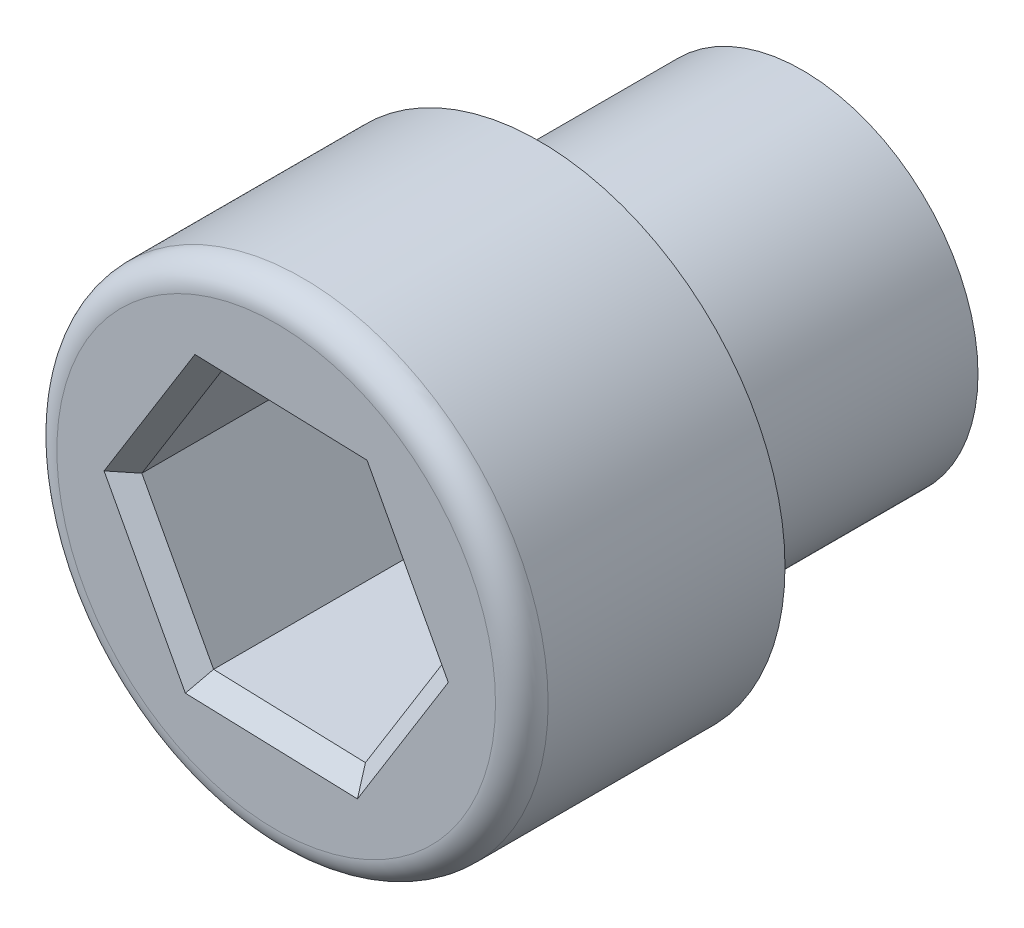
from build123d import *

# Parameters (mm, degrees)
SZKIC1_R                    = 2
DODANIE_WYCI_GNI_CIE1_DEPTH = 3
SZKIC2_R                    = 2.8
DODANIE_WYCI_GNI_CIE2_DEPTH = 3
ZAOKR_GLENIE1_R             = 0.3
WYTNIJ_WYCI_GNI_CIE1_DEPTH  = 3
SFAZOWANIE1_SIZE            = 0.2


with BuildPart() as part:
    # Szkic1 → Dodanie-wyci_gni_cie1 (new body)
    with BuildSketch(Plane.XY):
        Circle(SZKIC1_R)
    extrude(amount=DODANIE_WYCI_GNI_CIE1_DEPTH)

    # Szkic2 → Dodanie-wyci_gni_cie2 (add)
    with BuildSketch(Plane.XY.offset(3)):
        Circle(SZKIC2_R)
    extrude(amount=DODANIE_WYCI_GNI_CIE2_DEPTH)

    # Zaokr_glenie1
    zaokr_glenie1_edges = [part.edges().sort_by_distance(p)[0] for p in [
        (-2.8, 0, 6),
    ]]
    fillet(zaokr_glenie1_edges, radius=ZAOKR_GLENIE1_R)

    # Szkic3 → Wytnij-wyci_gni_cie1 (cut)
    with BuildSketch(Plane.XY.offset(6)):
        Polygon((-0.817437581, 1.527021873), (-1.731158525, 0.055589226), (-0.913720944, -1.471432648), (0.817437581, -1.527021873), (1.731158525, -0.055589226), (0.913720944, 1.471432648), align=None)
    extrude(amount=-WYTNIJ_WYCI_GNI_CIE1_DEPTH, mode=Mode.SUBTRACT)

    # Sfazowanie1
    sfazowanie1_edges = [part.edges().sort_by_distance(p)[0] for p in [
        (0.048141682, 1.49922726, 6),
        (-1.274298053, 0.79130555, 6),
        (-1.322439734, -0.707921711, 6),
        (-0.048141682, -1.49922726, 6),
        (1.274298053, -0.79130555, 6),
        (1.322439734, 0.707921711, 6),
    ]]
    chamfer(sfazowanie1_edges, length=SFAZOWANIE1_SIZE)


solid = part.part
